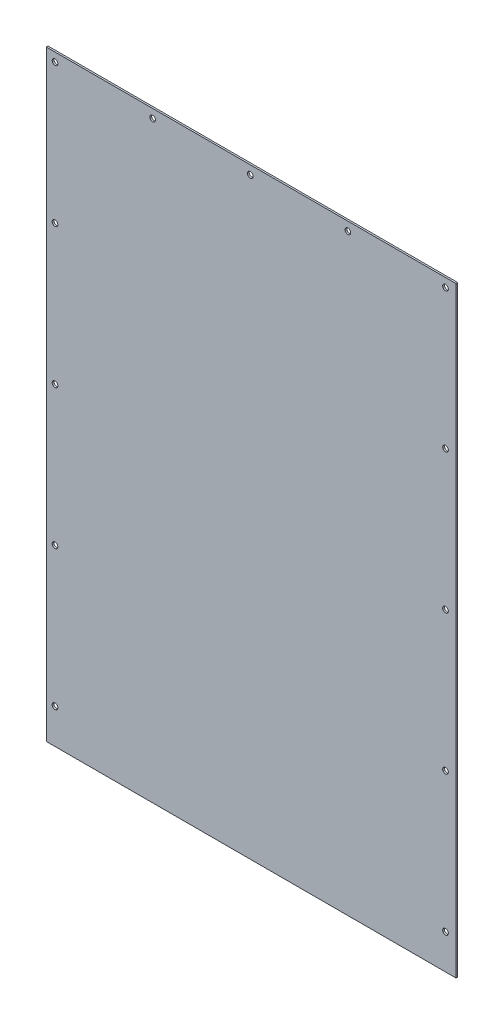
ISO-10303-21;
HEADER;
FILE_DESCRIPTION(('STEP AP214'),'2;1');
FILE_NAME('part.step','',(''),(''),'','','');
FILE_SCHEMA(('AUTOMOTIVE_DESIGN { 1 0 10303 214 1 1 1 1 }'));
ENDSEC;
DATA;
#1=APPLICATION_CONTEXT('core data for automotive mechanical design processes');
#2=APPLICATION_PROTOCOL_DEFINITION('international standard','automotive_design',2000,#1);
#3=PRODUCT_CONTEXT('',#1,'mechanical');
#4=PRODUCT('Part','Part','',(#3));
#5=PRODUCT_RELATED_PRODUCT_CATEGORY('part','',(#4));
#6=PRODUCT_DEFINITION_FORMATION('','',#4);
#7=PRODUCT_DEFINITION_CONTEXT('part definition',#1,'design');
#8=PRODUCT_DEFINITION('design','',#6,#7);
#9=PRODUCT_DEFINITION_SHAPE('','',#8);
#10=(LENGTH_UNIT() NAMED_UNIT(*) SI_UNIT(.MILLI.,.METRE.));
#11=(NAMED_UNIT(*) PLANE_ANGLE_UNIT() SI_UNIT($,.RADIAN.));
#12=(NAMED_UNIT(*) SI_UNIT($,.STERADIAN.) SOLID_ANGLE_UNIT());
#13=UNCERTAINTY_MEASURE_WITH_UNIT(LENGTH_MEASURE(1.E-05),#10,'distance_accuracy_value','');
#14=(GEOMETRIC_REPRESENTATION_CONTEXT(3) GLOBAL_UNCERTAINTY_ASSIGNED_CONTEXT((#13)) GLOBAL_UNIT_ASSIGNED_CONTEXT((#10,
#11,#12)) REPRESENTATION_CONTEXT('',''));
#15=CARTESIAN_POINT('',(0.,0.,0.));
#16=DIRECTION('',(0.,0.,1.));
#17=DIRECTION('',(1.,0.,0.));
#18=AXIS2_PLACEMENT_3D('',#15,#16,#17);
#19=CARTESIAN_POINT('',(0.,0.,2.));
#20=DIRECTION('',(1.,0.,0.));
#21=DIRECTION('',(0.,1.,0.));
#22=AXIS2_PLACEMENT_3D('',#19,#20,#21);
#23=PLANE('',#22);
#24=DIRECTION('',(0.,-1.,0.));
#25=VECTOR('',#24,1.);
#26=CARTESIAN_POINT('',(0.,0.,0.));
#27=LINE('',#26,#25);
#28=CARTESIAN_POINT('',(-1.11022302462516E-13,690.,0.));
#29=VERTEX_POINT('',#28);
#30=CARTESIAN_POINT('',(0.,0.,0.));
#31=VERTEX_POINT('',#30);
#32=EDGE_CURVE('E104',#29,#31,#27,.T.);
#33=ORIENTED_EDGE('',*,*,#32,.T.);
#34=DIRECTION('',(0.,0.,-1.));
#35=VECTOR('',#34,1.);
#36=CARTESIAN_POINT('',(0.,0.,2.));
#37=LINE('',#36,#35);
#38=CARTESIAN_POINT('',(0.,0.,2.));
#39=VERTEX_POINT('',#38);
#40=EDGE_CURVE('E95',#39,#31,#37,.T.);
#41=ORIENTED_EDGE('',*,*,#40,.F.);
#42=DIRECTION('',(0.,-1.,0.));
#43=VECTOR('',#42,1.);
#44=CARTESIAN_POINT('',(0.,0.,2.));
#45=LINE('',#44,#43);
#46=CARTESIAN_POINT('',(-1.11022302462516E-13,690.,2.));
#47=VERTEX_POINT('',#46);
#48=EDGE_CURVE('E89',#47,#39,#45,.T.);
#49=ORIENTED_EDGE('',*,*,#48,.F.);
#50=DIRECTION('',(0.,0.,-1.));
#51=VECTOR('',#50,1.);
#52=CARTESIAN_POINT('',(-1.11022302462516E-13,690.,2.));
#53=LINE('',#52,#51);
#54=EDGE_CURVE('E100',#47,#29,#53,.T.);
#55=ORIENTED_EDGE('',*,*,#54,.T.);
#56=EDGE_LOOP('',(#33,#41,#49,#55));
#57=FACE_BOUND('',#56,.T.);
#58=ADVANCED_FACE('F35',(#57),#23,.F.);
#59=CARTESIAN_POINT('',(0.,0.,2.));
#60=DIRECTION('',(0.,1.,0.));
#61=DIRECTION('',(0.,0.,1.));
#62=AXIS2_PLACEMENT_3D('',#59,#60,#61);
#63=PLANE('',#62);
#64=DIRECTION('',(1.,0.,0.));
#65=VECTOR('',#64,1.);
#66=CARTESIAN_POINT('',(0.,0.,0.));
#67=LINE('',#66,#65);
#68=CARTESIAN_POINT('',(470.,0.,0.));
#69=VERTEX_POINT('',#68);
#70=EDGE_CURVE('E94',#31,#69,#67,.T.);
#71=ORIENTED_EDGE('',*,*,#70,.T.);
#72=DIRECTION('',(0.,0.,-1.));
#73=VECTOR('',#72,1.);
#74=CARTESIAN_POINT('',(470.,0.,2.));
#75=LINE('',#74,#73);
#76=CARTESIAN_POINT('',(470.,0.,2.));
#77=VERTEX_POINT('',#76);
#78=EDGE_CURVE('E92',#77,#69,#75,.T.);
#79=ORIENTED_EDGE('',*,*,#78,.F.);
#80=DIRECTION('',(1.,0.,0.));
#81=VECTOR('',#80,1.);
#82=CARTESIAN_POINT('',(0.,0.,2.));
#83=LINE('',#82,#81);
#84=EDGE_CURVE('E83',#39,#77,#83,.T.);
#85=ORIENTED_EDGE('',*,*,#84,.F.);
#86=ORIENTED_EDGE('',*,*,#40,.T.);
#87=EDGE_LOOP('',(#71,#79,#85,#86));
#88=FACE_BOUND('',#87,.T.);
#89=ADVANCED_FACE('F93',(#88),#63,.F.);
#90=CARTESIAN_POINT('',(470.,0.,2.));
#91=DIRECTION('',(-1.,0.,0.));
#92=DIRECTION('',(0.,-1.,0.));
#93=AXIS2_PLACEMENT_3D('',#90,#91,#92);
#94=PLANE('',#93);
#95=DIRECTION('',(0.,1.,0.));
#96=VECTOR('',#95,1.);
#97=CARTESIAN_POINT('',(470.,0.,0.));
#98=LINE('',#97,#96);
#99=CARTESIAN_POINT('',(470.,690.,0.));
#100=VERTEX_POINT('',#99);
#101=EDGE_CURVE('E69',#69,#100,#98,.T.);
#102=ORIENTED_EDGE('',*,*,#101,.T.);
#103=DIRECTION('',(0.,0.,-1.));
#104=VECTOR('',#103,1.);
#105=CARTESIAN_POINT('',(470.,690.,2.));
#106=LINE('',#105,#104);
#107=CARTESIAN_POINT('',(470.,690.,2.));
#108=VERTEX_POINT('',#107);
#109=EDGE_CURVE('E96',#108,#100,#106,.T.);
#110=ORIENTED_EDGE('',*,*,#109,.F.);
#111=DIRECTION('',(0.,1.,0.));
#112=VECTOR('',#111,1.);
#113=CARTESIAN_POINT('',(470.,0.,2.));
#114=LINE('',#113,#112);
#115=EDGE_CURVE('E87',#77,#108,#114,.T.);
#116=ORIENTED_EDGE('',*,*,#115,.F.);
#117=ORIENTED_EDGE('',*,*,#78,.T.);
#118=EDGE_LOOP('',(#102,#110,#116,#117));
#119=FACE_BOUND('',#118,.T.);
#120=ADVANCED_FACE('F98',(#119),#94,.F.);
#121=CARTESIAN_POINT('',(-1.11022302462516E-13,690.,2.));
#122=DIRECTION('',(0.,-1.,0.));
#123=DIRECTION('',(0.,0.,-1.));
#124=AXIS2_PLACEMENT_3D('',#121,#122,#123);
#125=PLANE('',#124);
#126=DIRECTION('',(-1.,0.,0.));
#127=VECTOR('',#126,1.);
#128=CARTESIAN_POINT('',(-1.11022302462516E-13,690.,0.));
#129=LINE('',#128,#127);
#130=EDGE_CURVE('E75',#100,#29,#129,.T.);
#131=ORIENTED_EDGE('',*,*,#130,.T.);
#132=ORIENTED_EDGE('',*,*,#54,.F.);
#133=DIRECTION('',(-1.,0.,0.));
#134=VECTOR('',#133,1.);
#135=CARTESIAN_POINT('',(-1.11022302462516E-13,690.,2.));
#136=LINE('',#135,#134);
#137=EDGE_CURVE('E52',#108,#47,#136,.T.);
#138=ORIENTED_EDGE('',*,*,#137,.F.);
#139=ORIENTED_EDGE('',*,*,#109,.T.);
#140=EDGE_LOOP('',(#131,#132,#138,#139));
#141=FACE_BOUND('',#140,.T.);
#142=ADVANCED_FACE('F184',(#141),#125,.F.);
#143=CARTESIAN_POINT('',(0.,0.,2.));
#144=DIRECTION('',(0.,0.,-1.));
#145=DIRECTION('',(-1.,0.,0.));
#146=AXIS2_PLACEMENT_3D('',#143,#144,#145);
#147=PLANE('',#146);
#148=CARTESIAN_POINT('',(122.,680.,2.));
#149=DIRECTION('',(0.,0.,1.));
#150=DIRECTION('',(1.,0.,0.));
#151=AXIS2_PLACEMENT_3D('',#148,#149,#150);
#152=CIRCLE('',#151,3.24999999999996);
#153=CARTESIAN_POINT('',(125.25,680.,2.));
#154=VERTEX_POINT('',#153);
#155=EDGE_CURVE('E372',#154,#154,#152,.T.);
#156=ORIENTED_EDGE('',*,*,#155,.F.);
#157=EDGE_LOOP('',(#156));
#158=FACE_BOUND('',#157,.T.);
#159=CARTESIAN_POINT('',(9.99999999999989,680.,2.));
#160=DIRECTION('',(0.,0.,1.));
#161=DIRECTION('',(1.,0.,0.));
#162=AXIS2_PLACEMENT_3D('',#159,#160,#161);
#163=CIRCLE('',#162,3.24999999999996);
#164=CARTESIAN_POINT('',(13.2499999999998,680.,2.));
#165=VERTEX_POINT('',#164);
#166=EDGE_CURVE('E371',#165,#165,#163,.T.);
#167=ORIENTED_EDGE('',*,*,#166,.F.);
#168=EDGE_LOOP('',(#167));
#169=FACE_BOUND('',#168,.T.);
#170=ORIENTED_EDGE('',*,*,#48,.T.);
#171=ORIENTED_EDGE('',*,*,#84,.T.);
#172=ORIENTED_EDGE('',*,*,#115,.T.);
#173=ORIENTED_EDGE('',*,*,#137,.T.);
#174=EDGE_LOOP('',(#170,#171,#172,#173));
#175=FACE_BOUND('',#174,.T.);
#176=CARTESIAN_POINT('',(234.,680.,2.));
#177=DIRECTION('',(0.,0.,1.));
#178=DIRECTION('',(1.,0.,0.));
#179=AXIS2_PLACEMENT_3D('',#176,#177,#178);
#180=CIRCLE('',#179,3.24999999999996);
#181=CARTESIAN_POINT('',(237.25,680.,2.));
#182=VERTEX_POINT('',#181);
#183=EDGE_CURVE('E117',#182,#182,#180,.T.);
#184=ORIENTED_EDGE('',*,*,#183,.F.);
#185=EDGE_LOOP('',(#184));
#186=FACE_BOUND('',#185,.T.);
#187=CARTESIAN_POINT('',(346.,680.,2.));
#188=DIRECTION('',(0.,0.,1.));
#189=DIRECTION('',(1.,0.,0.));
#190=AXIS2_PLACEMENT_3D('',#187,#188,#189);
#191=CIRCLE('',#190,3.24999999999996);
#192=CARTESIAN_POINT('',(349.25,680.,2.));
#193=VERTEX_POINT('',#192);
#194=EDGE_CURVE('E123',#193,#193,#191,.T.);
#195=ORIENTED_EDGE('',*,*,#194,.F.);
#196=EDGE_LOOP('',(#195));
#197=FACE_BOUND('',#196,.T.);
#198=CARTESIAN_POINT('',(458.,680.,2.));
#199=DIRECTION('',(0.,0.,1.));
#200=DIRECTION('',(1.,0.,0.));
#201=AXIS2_PLACEMENT_3D('',#198,#199,#200);
#202=CIRCLE('',#201,3.24999999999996);
#203=CARTESIAN_POINT('',(461.25,680.,2.));
#204=VERTEX_POINT('',#203);
#205=EDGE_CURVE('E129',#204,#204,#202,.T.);
#206=ORIENTED_EDGE('',*,*,#205,.F.);
#207=EDGE_LOOP('',(#206));
#208=FACE_BOUND('',#207,.T.);
#209=CARTESIAN_POINT('',(9.99999999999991,520.,2.));
#210=DIRECTION('',(0.,0.,1.));
#211=DIRECTION('',(1.,0.,0.));
#212=AXIS2_PLACEMENT_3D('',#209,#210,#211);
#213=CIRCLE('',#212,3.24999999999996);
#214=CARTESIAN_POINT('',(13.2499999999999,520.,2.));
#215=VERTEX_POINT('',#214);
#216=EDGE_CURVE('E135',#215,#215,#213,.T.);
#217=ORIENTED_EDGE('',*,*,#216,.F.);
#218=EDGE_LOOP('',(#217));
#219=FACE_BOUND('',#218,.T.);
#220=CARTESIAN_POINT('',(458.,520.,2.));
#221=DIRECTION('',(0.,0.,1.));
#222=DIRECTION('',(1.,0.,0.));
#223=AXIS2_PLACEMENT_3D('',#220,#221,#222);
#224=CIRCLE('',#223,3.24999999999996);
#225=CARTESIAN_POINT('',(461.25,520.,2.));
#226=VERTEX_POINT('',#225);
#227=EDGE_CURVE('E141',#226,#226,#224,.T.);
#228=ORIENTED_EDGE('',*,*,#227,.F.);
#229=EDGE_LOOP('',(#228));
#230=FACE_BOUND('',#229,.T.);
#231=CARTESIAN_POINT('',(9.99999999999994,360.,2.));
#232=DIRECTION('',(0.,0.,1.));
#233=DIRECTION('',(1.,0.,0.));
#234=AXIS2_PLACEMENT_3D('',#231,#232,#233);
#235=CIRCLE('',#234,3.24999999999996);
#236=CARTESIAN_POINT('',(13.2499999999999,360.,2.));
#237=VERTEX_POINT('',#236);
#238=EDGE_CURVE('E147',#237,#237,#235,.T.);
#239=ORIENTED_EDGE('',*,*,#238,.F.);
#240=EDGE_LOOP('',(#239));
#241=FACE_BOUND('',#240,.T.);
#242=CARTESIAN_POINT('',(458.,360.,2.));
#243=DIRECTION('',(0.,0.,1.));
#244=DIRECTION('',(1.,0.,0.));
#245=AXIS2_PLACEMENT_3D('',#242,#243,#244);
#246=CIRCLE('',#245,3.24999999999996);
#247=CARTESIAN_POINT('',(461.25,360.,2.));
#248=VERTEX_POINT('',#247);
#249=EDGE_CURVE('E153',#248,#248,#246,.T.);
#250=ORIENTED_EDGE('',*,*,#249,.F.);
#251=EDGE_LOOP('',(#250));
#252=FACE_BOUND('',#251,.T.);
#253=CARTESIAN_POINT('',(9.99999999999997,200.,2.));
#254=DIRECTION('',(0.,0.,1.));
#255=DIRECTION('',(1.,0.,0.));
#256=AXIS2_PLACEMENT_3D('',#253,#254,#255);
#257=CIRCLE('',#256,3.24999999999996);
#258=CARTESIAN_POINT('',(13.2499999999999,200.,2.));
#259=VERTEX_POINT('',#258);
#260=EDGE_CURVE('E159',#259,#259,#257,.T.);
#261=ORIENTED_EDGE('',*,*,#260,.F.);
#262=EDGE_LOOP('',(#261));
#263=FACE_BOUND('',#262,.T.);
#264=CARTESIAN_POINT('',(458.,200.,2.));
#265=DIRECTION('',(0.,0.,1.));
#266=DIRECTION('',(1.,0.,0.));
#267=AXIS2_PLACEMENT_3D('',#264,#265,#266);
#268=CIRCLE('',#267,3.24999999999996);
#269=CARTESIAN_POINT('',(461.25,200.,2.));
#270=VERTEX_POINT('',#269);
#271=EDGE_CURVE('E165',#270,#270,#268,.T.);
#272=ORIENTED_EDGE('',*,*,#271,.F.);
#273=EDGE_LOOP('',(#272));
#274=FACE_BOUND('',#273,.T.);
#275=CARTESIAN_POINT('',(9.99999999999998,40.,2.));
#276=DIRECTION('',(0.,0.,1.));
#277=DIRECTION('',(1.,0.,0.));
#278=AXIS2_PLACEMENT_3D('',#275,#276,#277);
#279=CIRCLE('',#278,3.24999999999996);
#280=CARTESIAN_POINT('',(13.2499999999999,40.,2.));
#281=VERTEX_POINT('',#280);
#282=EDGE_CURVE('E171',#281,#281,#279,.T.);
#283=ORIENTED_EDGE('',*,*,#282,.F.);
#284=EDGE_LOOP('',(#283));
#285=FACE_BOUND('',#284,.T.);
#286=CARTESIAN_POINT('',(458.,40.,2.));
#287=DIRECTION('',(0.,0.,1.));
#288=DIRECTION('',(1.,0.,0.));
#289=AXIS2_PLACEMENT_3D('',#286,#287,#288);
#290=CIRCLE('',#289,3.24999999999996);
#291=CARTESIAN_POINT('',(461.25,40.,2.));
#292=VERTEX_POINT('',#291);
#293=EDGE_CURVE('E11',#292,#292,#290,.T.);
#294=ORIENTED_EDGE('',*,*,#293,.F.);
#295=EDGE_LOOP('',(#294));
#296=FACE_BOUND('',#295,.T.);
#297=ADVANCED_FACE('F84',(#158,#169,#175,#186,#197,#208,#219,#230,#241,#252,#263,#274,#285,
#296),#147,.F.);
#298=CARTESIAN_POINT('',(0.,0.,0.));
#299=DIRECTION('',(0.,0.,-1.));
#300=DIRECTION('',(-1.,0.,0.));
#301=AXIS2_PLACEMENT_3D('',#298,#299,#300);
#302=PLANE('',#301);
#303=CARTESIAN_POINT('',(122.,680.,0.));
#304=DIRECTION('',(0.,0.,1.));
#305=DIRECTION('',(1.,0.,0.));
#306=AXIS2_PLACEMENT_3D('',#303,#304,#305);
#307=CIRCLE('',#306,3.24999999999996);
#308=CARTESIAN_POINT('',(125.25,680.,0.));
#309=VERTEX_POINT('',#308);
#310=EDGE_CURVE('E376',#309,#309,#307,.T.);
#311=ORIENTED_EDGE('',*,*,#310,.T.);
#312=EDGE_LOOP('',(#311));
#313=FACE_BOUND('',#312,.T.);
#314=CARTESIAN_POINT('',(9.99999999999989,680.,0.));
#315=DIRECTION('',(0.,0.,1.));
#316=DIRECTION('',(1.,0.,0.));
#317=AXIS2_PLACEMENT_3D('',#314,#315,#316);
#318=CIRCLE('',#317,3.24999999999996);
#319=CARTESIAN_POINT('',(13.2499999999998,680.,0.));
#320=VERTEX_POINT('',#319);
#321=EDGE_CURVE('E107',#320,#320,#318,.T.);
#322=ORIENTED_EDGE('',*,*,#321,.T.);
#323=EDGE_LOOP('',(#322));
#324=FACE_BOUND('',#323,.T.);
#325=ORIENTED_EDGE('',*,*,#32,.F.);
#326=ORIENTED_EDGE('',*,*,#130,.F.);
#327=ORIENTED_EDGE('',*,*,#101,.F.);
#328=ORIENTED_EDGE('',*,*,#70,.F.);
#329=EDGE_LOOP('',(#325,#326,#327,#328));
#330=FACE_BOUND('',#329,.T.);
#331=CARTESIAN_POINT('',(234.,680.,0.));
#332=DIRECTION('',(0.,0.,1.));
#333=DIRECTION('',(1.,0.,0.));
#334=AXIS2_PLACEMENT_3D('',#331,#332,#333);
#335=CIRCLE('',#334,3.24999999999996);
#336=CARTESIAN_POINT('',(237.25,680.,0.));
#337=VERTEX_POINT('',#336);
#338=EDGE_CURVE('E114',#337,#337,#335,.T.);
#339=ORIENTED_EDGE('',*,*,#338,.T.);
#340=EDGE_LOOP('',(#339));
#341=FACE_BOUND('',#340,.T.);
#342=CARTESIAN_POINT('',(346.,680.,0.));
#343=DIRECTION('',(0.,0.,1.));
#344=DIRECTION('',(1.,0.,0.));
#345=AXIS2_PLACEMENT_3D('',#342,#343,#344);
#346=CIRCLE('',#345,3.24999999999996);
#347=CARTESIAN_POINT('',(349.25,680.,0.));
#348=VERTEX_POINT('',#347);
#349=EDGE_CURVE('E120',#348,#348,#346,.T.);
#350=ORIENTED_EDGE('',*,*,#349,.T.);
#351=EDGE_LOOP('',(#350));
#352=FACE_BOUND('',#351,.T.);
#353=CARTESIAN_POINT('',(458.,680.,0.));
#354=DIRECTION('',(0.,0.,1.));
#355=DIRECTION('',(1.,0.,0.));
#356=AXIS2_PLACEMENT_3D('',#353,#354,#355);
#357=CIRCLE('',#356,3.24999999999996);
#358=CARTESIAN_POINT('',(461.25,680.,0.));
#359=VERTEX_POINT('',#358);
#360=EDGE_CURVE('E126',#359,#359,#357,.T.);
#361=ORIENTED_EDGE('',*,*,#360,.T.);
#362=EDGE_LOOP('',(#361));
#363=FACE_BOUND('',#362,.T.);
#364=CARTESIAN_POINT('',(9.99999999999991,520.,0.));
#365=DIRECTION('',(0.,0.,1.));
#366=DIRECTION('',(1.,0.,0.));
#367=AXIS2_PLACEMENT_3D('',#364,#365,#366);
#368=CIRCLE('',#367,3.24999999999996);
#369=CARTESIAN_POINT('',(13.2499999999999,520.,0.));
#370=VERTEX_POINT('',#369);
#371=EDGE_CURVE('E132',#370,#370,#368,.T.);
#372=ORIENTED_EDGE('',*,*,#371,.T.);
#373=EDGE_LOOP('',(#372));
#374=FACE_BOUND('',#373,.T.);
#375=CARTESIAN_POINT('',(458.,520.,0.));
#376=DIRECTION('',(0.,0.,1.));
#377=DIRECTION('',(1.,0.,0.));
#378=AXIS2_PLACEMENT_3D('',#375,#376,#377);
#379=CIRCLE('',#378,3.24999999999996);
#380=CARTESIAN_POINT('',(461.25,520.,0.));
#381=VERTEX_POINT('',#380);
#382=EDGE_CURVE('E138',#381,#381,#379,.T.);
#383=ORIENTED_EDGE('',*,*,#382,.T.);
#384=EDGE_LOOP('',(#383));
#385=FACE_BOUND('',#384,.T.);
#386=CARTESIAN_POINT('',(9.99999999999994,360.,0.));
#387=DIRECTION('',(0.,0.,1.));
#388=DIRECTION('',(1.,0.,0.));
#389=AXIS2_PLACEMENT_3D('',#386,#387,#388);
#390=CIRCLE('',#389,3.24999999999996);
#391=CARTESIAN_POINT('',(13.2499999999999,360.,0.));
#392=VERTEX_POINT('',#391);
#393=EDGE_CURVE('E144',#392,#392,#390,.T.);
#394=ORIENTED_EDGE('',*,*,#393,.T.);
#395=EDGE_LOOP('',(#394));
#396=FACE_BOUND('',#395,.T.);
#397=CARTESIAN_POINT('',(458.,360.,0.));
#398=DIRECTION('',(0.,0.,1.));
#399=DIRECTION('',(1.,0.,0.));
#400=AXIS2_PLACEMENT_3D('',#397,#398,#399);
#401=CIRCLE('',#400,3.24999999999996);
#402=CARTESIAN_POINT('',(461.25,360.,0.));
#403=VERTEX_POINT('',#402);
#404=EDGE_CURVE('E150',#403,#403,#401,.T.);
#405=ORIENTED_EDGE('',*,*,#404,.T.);
#406=EDGE_LOOP('',(#405));
#407=FACE_BOUND('',#406,.T.);
#408=CARTESIAN_POINT('',(9.99999999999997,200.,0.));
#409=DIRECTION('',(0.,0.,1.));
#410=DIRECTION('',(1.,0.,0.));
#411=AXIS2_PLACEMENT_3D('',#408,#409,#410);
#412=CIRCLE('',#411,3.24999999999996);
#413=CARTESIAN_POINT('',(13.2499999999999,200.,0.));
#414=VERTEX_POINT('',#413);
#415=EDGE_CURVE('E156',#414,#414,#412,.T.);
#416=ORIENTED_EDGE('',*,*,#415,.T.);
#417=EDGE_LOOP('',(#416));
#418=FACE_BOUND('',#417,.T.);
#419=CARTESIAN_POINT('',(458.,200.,0.));
#420=DIRECTION('',(0.,0.,1.));
#421=DIRECTION('',(1.,0.,0.));
#422=AXIS2_PLACEMENT_3D('',#419,#420,#421);
#423=CIRCLE('',#422,3.24999999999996);
#424=CARTESIAN_POINT('',(461.25,200.,0.));
#425=VERTEX_POINT('',#424);
#426=EDGE_CURVE('E162',#425,#425,#423,.T.);
#427=ORIENTED_EDGE('',*,*,#426,.T.);
#428=EDGE_LOOP('',(#427));
#429=FACE_BOUND('',#428,.T.);
#430=CARTESIAN_POINT('',(9.99999999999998,40.,0.));
#431=DIRECTION('',(0.,0.,1.));
#432=DIRECTION('',(1.,0.,0.));
#433=AXIS2_PLACEMENT_3D('',#430,#431,#432);
#434=CIRCLE('',#433,3.24999999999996);
#435=CARTESIAN_POINT('',(13.2499999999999,40.,0.));
#436=VERTEX_POINT('',#435);
#437=EDGE_CURVE('E168',#436,#436,#434,.T.);
#438=ORIENTED_EDGE('',*,*,#437,.T.);
#439=EDGE_LOOP('',(#438));
#440=FACE_BOUND('',#439,.T.);
#441=CARTESIAN_POINT('',(458.,40.,0.));
#442=DIRECTION('',(0.,0.,1.));
#443=DIRECTION('',(1.,0.,0.));
#444=AXIS2_PLACEMENT_3D('',#441,#442,#443);
#445=CIRCLE('',#444,3.24999999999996);
#446=CARTESIAN_POINT('',(461.25,40.,0.));
#447=VERTEX_POINT('',#446);
#448=EDGE_CURVE('E44',#447,#447,#445,.T.);
#449=ORIENTED_EDGE('',*,*,#448,.T.);
#450=EDGE_LOOP('',(#449));
#451=FACE_BOUND('',#450,.T.);
#452=ADVANCED_FACE('F176',(#313,#324,#330,#341,#352,#363,#374,#385,#396,#407,#418,#429,#440,
#451),#302,.T.);
#453=CARTESIAN_POINT('',(9.99999999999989,680.,0.));
#454=DIRECTION('',(0.,0.,1.));
#455=DIRECTION('',(1.,0.,0.));
#456=AXIS2_PLACEMENT_3D('',#453,#454,#455);
#457=CYLINDRICAL_SURFACE('',#456,3.24999999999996);
#458=ORIENTED_EDGE('',*,*,#321,.F.);
#459=EDGE_LOOP('',(#458));
#460=FACE_BOUND('',#459,.T.);
#461=ORIENTED_EDGE('',*,*,#166,.T.);
#462=EDGE_LOOP('',(#461));
#463=FACE_BOUND('',#462,.T.);
#464=ADVANCED_FACE('F191',(#460,#463),#457,.F.);
#465=CARTESIAN_POINT('',(122.,680.,0.));
#466=DIRECTION('',(0.,0.,1.));
#467=DIRECTION('',(1.,0.,0.));
#468=AXIS2_PLACEMENT_3D('',#465,#466,#467);
#469=CYLINDRICAL_SURFACE('',#468,3.24999999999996);
#470=ORIENTED_EDGE('',*,*,#310,.F.);
#471=EDGE_LOOP('',(#470));
#472=FACE_BOUND('',#471,.T.);
#473=ORIENTED_EDGE('',*,*,#155,.T.);
#474=EDGE_LOOP('',(#473));
#475=FACE_BOUND('',#474,.T.);
#476=ADVANCED_FACE('F211',(#472,#475),#469,.F.);
#477=CARTESIAN_POINT('',(234.,680.,0.));
#478=DIRECTION('',(0.,0.,1.));
#479=DIRECTION('',(1.,0.,0.));
#480=AXIS2_PLACEMENT_3D('',#477,#478,#479);
#481=CYLINDRICAL_SURFACE('',#480,3.24999999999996);
#482=ORIENTED_EDGE('',*,*,#338,.F.);
#483=EDGE_LOOP('',(#482));
#484=FACE_BOUND('',#483,.T.);
#485=ORIENTED_EDGE('',*,*,#183,.T.);
#486=EDGE_LOOP('',(#485));
#487=FACE_BOUND('',#486,.T.);
#488=ADVANCED_FACE('F207',(#484,#487),#481,.F.);
#489=CARTESIAN_POINT('',(346.,680.,0.));
#490=DIRECTION('',(0.,0.,1.));
#491=DIRECTION('',(1.,0.,0.));
#492=AXIS2_PLACEMENT_3D('',#489,#490,#491);
#493=CYLINDRICAL_SURFACE('',#492,3.24999999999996);
#494=ORIENTED_EDGE('',*,*,#349,.F.);
#495=EDGE_LOOP('',(#494));
#496=FACE_BOUND('',#495,.T.);
#497=ORIENTED_EDGE('',*,*,#194,.T.);
#498=EDGE_LOOP('',(#497));
#499=FACE_BOUND('',#498,.T.);
#500=ADVANCED_FACE('F210',(#496,#499),#493,.F.);
#501=CARTESIAN_POINT('',(458.,680.,0.));
#502=DIRECTION('',(0.,0.,1.));
#503=DIRECTION('',(1.,0.,0.));
#504=AXIS2_PLACEMENT_3D('',#501,#502,#503);
#505=CYLINDRICAL_SURFACE('',#504,3.24999999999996);
#506=ORIENTED_EDGE('',*,*,#360,.F.);
#507=EDGE_LOOP('',(#506));
#508=FACE_BOUND('',#507,.T.);
#509=ORIENTED_EDGE('',*,*,#205,.T.);
#510=EDGE_LOOP('',(#509));
#511=FACE_BOUND('',#510,.T.);
#512=ADVANCED_FACE('F215',(#508,#511),#505,.F.);
#513=CARTESIAN_POINT('',(9.99999999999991,520.,0.));
#514=DIRECTION('',(0.,0.,1.));
#515=DIRECTION('',(1.,0.,0.));
#516=AXIS2_PLACEMENT_3D('',#513,#514,#515);
#517=CYLINDRICAL_SURFACE('',#516,3.24999999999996);
#518=ORIENTED_EDGE('',*,*,#371,.F.);
#519=EDGE_LOOP('',(#518));
#520=FACE_BOUND('',#519,.T.);
#521=ORIENTED_EDGE('',*,*,#216,.T.);
#522=EDGE_LOOP('',(#521));
#523=FACE_BOUND('',#522,.T.);
#524=ADVANCED_FACE('F219',(#520,#523),#517,.F.);
#525=CARTESIAN_POINT('',(458.,520.,0.));
#526=DIRECTION('',(0.,0.,1.));
#527=DIRECTION('',(1.,0.,0.));
#528=AXIS2_PLACEMENT_3D('',#525,#526,#527);
#529=CYLINDRICAL_SURFACE('',#528,3.24999999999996);
#530=ORIENTED_EDGE('',*,*,#382,.F.);
#531=EDGE_LOOP('',(#530));
#532=FACE_BOUND('',#531,.T.);
#533=ORIENTED_EDGE('',*,*,#227,.T.);
#534=EDGE_LOOP('',(#533));
#535=FACE_BOUND('',#534,.T.);
#536=ADVANCED_FACE('F223',(#532,#535),#529,.F.);
#537=CARTESIAN_POINT('',(9.99999999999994,360.,0.));
#538=DIRECTION('',(0.,0.,1.));
#539=DIRECTION('',(1.,0.,0.));
#540=AXIS2_PLACEMENT_3D('',#537,#538,#539);
#541=CYLINDRICAL_SURFACE('',#540,3.24999999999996);
#542=ORIENTED_EDGE('',*,*,#393,.F.);
#543=EDGE_LOOP('',(#542));
#544=FACE_BOUND('',#543,.T.);
#545=ORIENTED_EDGE('',*,*,#238,.T.);
#546=EDGE_LOOP('',(#545));
#547=FACE_BOUND('',#546,.T.);
#548=ADVANCED_FACE('F227',(#544,#547),#541,.F.);
#549=CARTESIAN_POINT('',(458.,360.,0.));
#550=DIRECTION('',(0.,0.,1.));
#551=DIRECTION('',(1.,0.,0.));
#552=AXIS2_PLACEMENT_3D('',#549,#550,#551);
#553=CYLINDRICAL_SURFACE('',#552,3.24999999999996);
#554=ORIENTED_EDGE('',*,*,#404,.F.);
#555=EDGE_LOOP('',(#554));
#556=FACE_BOUND('',#555,.T.);
#557=ORIENTED_EDGE('',*,*,#249,.T.);
#558=EDGE_LOOP('',(#557));
#559=FACE_BOUND('',#558,.T.);
#560=ADVANCED_FACE('F231',(#556,#559),#553,.F.);
#561=CARTESIAN_POINT('',(9.99999999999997,200.,0.));
#562=DIRECTION('',(0.,0.,1.));
#563=DIRECTION('',(1.,0.,0.));
#564=AXIS2_PLACEMENT_3D('',#561,#562,#563);
#565=CYLINDRICAL_SURFACE('',#564,3.24999999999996);
#566=ORIENTED_EDGE('',*,*,#415,.F.);
#567=EDGE_LOOP('',(#566));
#568=FACE_BOUND('',#567,.T.);
#569=ORIENTED_EDGE('',*,*,#260,.T.);
#570=EDGE_LOOP('',(#569));
#571=FACE_BOUND('',#570,.T.);
#572=ADVANCED_FACE('F235',(#568,#571),#565,.F.);
#573=CARTESIAN_POINT('',(458.,200.,0.));
#574=DIRECTION('',(0.,0.,1.));
#575=DIRECTION('',(1.,0.,0.));
#576=AXIS2_PLACEMENT_3D('',#573,#574,#575);
#577=CYLINDRICAL_SURFACE('',#576,3.24999999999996);
#578=ORIENTED_EDGE('',*,*,#426,.F.);
#579=EDGE_LOOP('',(#578));
#580=FACE_BOUND('',#579,.T.);
#581=ORIENTED_EDGE('',*,*,#271,.T.);
#582=EDGE_LOOP('',(#581));
#583=FACE_BOUND('',#582,.T.);
#584=ADVANCED_FACE('F239',(#580,#583),#577,.F.);
#585=CARTESIAN_POINT('',(9.99999999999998,40.,0.));
#586=DIRECTION('',(0.,0.,1.));
#587=DIRECTION('',(1.,0.,0.));
#588=AXIS2_PLACEMENT_3D('',#585,#586,#587);
#589=CYLINDRICAL_SURFACE('',#588,3.24999999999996);
#590=ORIENTED_EDGE('',*,*,#437,.F.);
#591=EDGE_LOOP('',(#590));
#592=FACE_BOUND('',#591,.T.);
#593=ORIENTED_EDGE('',*,*,#282,.T.);
#594=EDGE_LOOP('',(#593));
#595=FACE_BOUND('',#594,.T.);
#596=ADVANCED_FACE('F180',(#592,#595),#589,.F.);
#597=CARTESIAN_POINT('',(458.,40.,0.));
#598=DIRECTION('',(0.,0.,1.));
#599=DIRECTION('',(1.,0.,0.));
#600=AXIS2_PLACEMENT_3D('',#597,#598,#599);
#601=CYLINDRICAL_SURFACE('',#600,3.24999999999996);
#602=ORIENTED_EDGE('',*,*,#448,.F.);
#603=EDGE_LOOP('',(#602));
#604=FACE_BOUND('',#603,.T.);
#605=ORIENTED_EDGE('',*,*,#293,.T.);
#606=EDGE_LOOP('',(#605));
#607=FACE_BOUND('',#606,.T.);
#608=ADVANCED_FACE('F37',(#604,#607),#601,.F.);
#609=CLOSED_SHELL('',(#58,#89,#120,#142,#297,#452,#464,#476,#488,#500,#512,#524,#536,#548,#560,
#572,#584,#596,#608));
#610=MANIFOLD_SOLID_BREP('B2',#609);
#611=ADVANCED_BREP_SHAPE_REPRESENTATION('',(#18,#610),#14);
#612=SHAPE_DEFINITION_REPRESENTATION(#9,#611);
ENDSEC;
END-ISO-10303-21;
